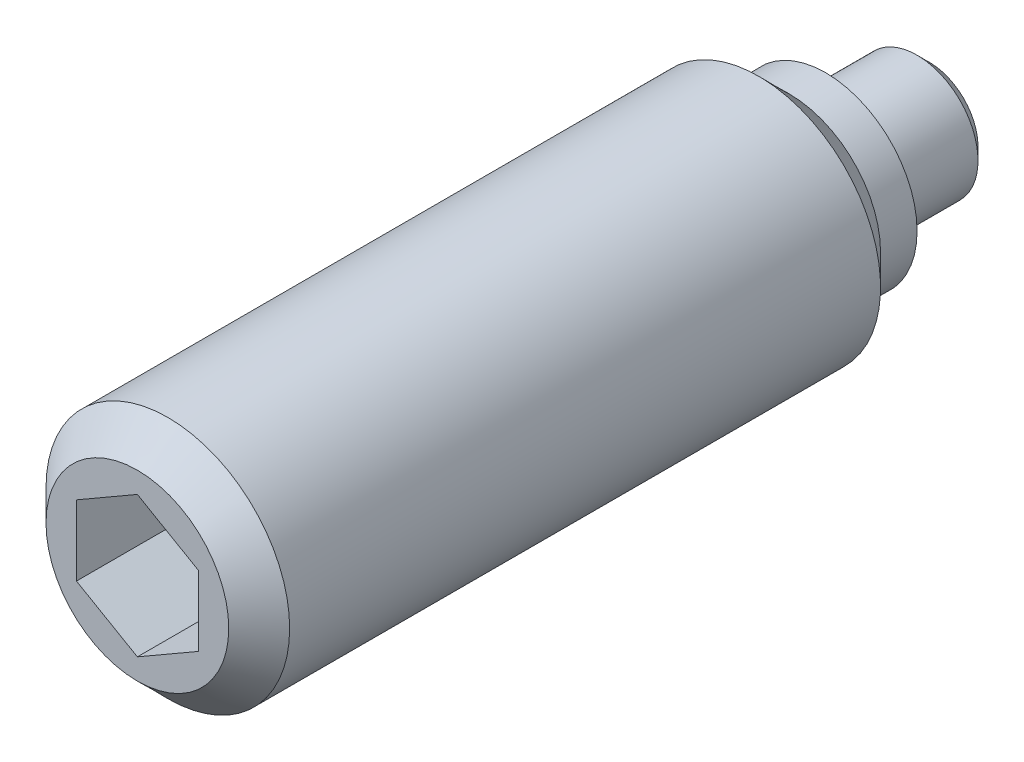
ISO-10303-21;
HEADER;
FILE_DESCRIPTION(('STEP AP214'),'2;1');
FILE_NAME('part.step','',(''),(''),'','','');
FILE_SCHEMA(('AUTOMOTIVE_DESIGN { 1 0 10303 214 1 1 1 1 }'));
ENDSEC;
DATA;
#1=APPLICATION_CONTEXT('core data for automotive mechanical design processes');
#2=APPLICATION_PROTOCOL_DEFINITION('international standard','automotive_design',2000,#1);
#3=PRODUCT_CONTEXT('',#1,'mechanical');
#4=PRODUCT('Part','Part','',(#3));
#5=PRODUCT_RELATED_PRODUCT_CATEGORY('part','',(#4));
#6=PRODUCT_DEFINITION_FORMATION('','',#4);
#7=PRODUCT_DEFINITION_CONTEXT('part definition',#1,'design');
#8=PRODUCT_DEFINITION('design','',#6,#7);
#9=PRODUCT_DEFINITION_SHAPE('','',#8);
#10=(LENGTH_UNIT() NAMED_UNIT(*) SI_UNIT(.MILLI.,.METRE.));
#11=(NAMED_UNIT(*) PLANE_ANGLE_UNIT() SI_UNIT($,.RADIAN.));
#12=(NAMED_UNIT(*) SI_UNIT($,.STERADIAN.) SOLID_ANGLE_UNIT());
#13=UNCERTAINTY_MEASURE_WITH_UNIT(LENGTH_MEASURE(1.E-05),#10,'distance_accuracy_value','');
#14=(GEOMETRIC_REPRESENTATION_CONTEXT(3) GLOBAL_UNCERTAINTY_ASSIGNED_CONTEXT((#13)) GLOBAL_UNIT_ASSIGNED_CONTEXT((#10,
#11,#12)) REPRESENTATION_CONTEXT('',''));
#15=CARTESIAN_POINT('',(0.,0.,0.));
#16=DIRECTION('',(0.,0.,1.));
#17=DIRECTION('',(1.,0.,0.));
#18=AXIS2_PLACEMENT_3D('',#15,#16,#17);
#19=CARTESIAN_POINT('',(0.,0.,0.));
#20=DIRECTION('',(0.,0.,-1.));
#21=DIRECTION('',(-1.,0.,0.));
#22=AXIS2_PLACEMENT_3D('',#19,#20,#21);
#23=CYLINDRICAL_SURFACE('',#22,1.);
#24=CARTESIAN_POINT('',(0.,0.,0.2));
#25=DIRECTION('',(0.,0.,-1.));
#26=DIRECTION('',(-1.,0.,0.));
#27=AXIS2_PLACEMENT_3D('',#24,#25,#26);
#28=CIRCLE('',#27,1.);
#29=CARTESIAN_POINT('',(-1.,0.,0.2));
#30=VERTEX_POINT('',#29);
#31=EDGE_CURVE('E133',#30,#30,#28,.T.);
#32=ORIENTED_EDGE('',*,*,#31,.F.);
#33=EDGE_LOOP('',(#32));
#34=FACE_BOUND('',#33,.T.);
#35=CARTESIAN_POINT('',(0.,0.,1.7));
#36=DIRECTION('',(0.,0.,-1.));
#37=DIRECTION('',(-1.,0.,0.));
#38=AXIS2_PLACEMENT_3D('',#35,#36,#37);
#39=CIRCLE('',#38,1.);
#40=CARTESIAN_POINT('',(-1.,0.,1.7));
#41=VERTEX_POINT('',#40);
#42=EDGE_CURVE('E127',#41,#41,#39,.T.);
#43=ORIENTED_EDGE('',*,*,#42,.T.);
#44=EDGE_LOOP('',(#43));
#45=FACE_BOUND('',#44,.T.);
#46=ADVANCED_FACE('F14',(#34,#45),#23,.T.);
#47=CARTESIAN_POINT('',(0.,0.,0.2));
#48=DIRECTION('',(0.,0.,1.));
#49=DIRECTION('',(1.,0.,0.));
#50=AXIS2_PLACEMENT_3D('',#47,#48,#49);
#51=CONICAL_SURFACE('',#50,1.,0.785398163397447);
#52=CARTESIAN_POINT('',(0.,0.,0.));
#53=DIRECTION('',(0.,0.,-1.));
#54=DIRECTION('',(-1.,0.,0.));
#55=AXIS2_PLACEMENT_3D('',#52,#53,#54);
#56=CIRCLE('',#55,0.8);
#57=CARTESIAN_POINT('',(-0.8,0.,0.));
#58=VERTEX_POINT('',#57);
#59=EDGE_CURVE('E130',#58,#58,#56,.T.);
#60=ORIENTED_EDGE('',*,*,#59,.F.);
#61=EDGE_LOOP('',(#60));
#62=FACE_BOUND('',#61,.T.);
#63=ORIENTED_EDGE('',*,*,#31,.T.);
#64=EDGE_LOOP('',(#63));
#65=FACE_BOUND('',#64,.T.);
#66=ADVANCED_FACE('F157',(#62,#65),#51,.T.);
#67=CARTESIAN_POINT('',(0.,0.8,0.));
#68=DIRECTION('',(0.,0.,1.));
#69=DIRECTION('',(1.,0.,0.));
#70=AXIS2_PLACEMENT_3D('',#67,#68,#69);
#71=PLANE('',#70);
#72=ORIENTED_EDGE('',*,*,#59,.T.);
#73=EDGE_LOOP('',(#72));
#74=FACE_BOUND('',#73,.T.);
#75=ADVANCED_FACE('F154',(#74),#71,.F.);
#76=CARTESIAN_POINT('',(0.,0.,1.7));
#77=DIRECTION('',(0.,0.,-1.));
#78=DIRECTION('',(-1.,0.,0.));
#79=AXIS2_PLACEMENT_3D('',#76,#77,#78);
#80=CYLINDRICAL_SURFACE('',#79,2.);
#81=CARTESIAN_POINT('',(0.,0.,2.8));
#82=DIRECTION('',(0.,0.,-1.));
#83=DIRECTION('',(-1.,0.,0.));
#84=AXIS2_PLACEMENT_3D('',#81,#82,#83);
#85=CIRCLE('',#84,2.);
#86=CARTESIAN_POINT('',(-2.,0.,2.8));
#87=VERTEX_POINT('',#86);
#88=EDGE_CURVE('E9',#87,#87,#85,.T.);
#89=ORIENTED_EDGE('',*,*,#88,.F.);
#90=EDGE_LOOP('',(#89));
#91=FACE_BOUND('',#90,.T.);
#92=CARTESIAN_POINT('',(0.,0.,12.5));
#93=DIRECTION('',(0.,0.,1.));
#94=DIRECTION('',(1.,0.,0.));
#95=AXIS2_PLACEMENT_3D('',#92,#93,#94);
#96=CIRCLE('',#95,2.);
#97=CARTESIAN_POINT('',(2.,0.,12.5));
#98=VERTEX_POINT('',#97);
#99=EDGE_CURVE('E124',#98,#98,#96,.T.);
#100=ORIENTED_EDGE('',*,*,#99,.F.);
#101=EDGE_LOOP('',(#100));
#102=FACE_BOUND('',#101,.T.);
#103=ADVANCED_FACE('F16',(#91,#102),#80,.T.);
#104=CARTESIAN_POINT('',(0.,0.,2.8));
#105=DIRECTION('',(0.,0.,1.));
#106=DIRECTION('',(1.,0.,0.));
#107=AXIS2_PLACEMENT_3D('',#104,#105,#106);
#108=CONICAL_SURFACE('',#107,2.,0.785398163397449);
#109=ORIENTED_EDGE('',*,*,#88,.T.);
#110=EDGE_LOOP('',(#109));
#111=FACE_BOUND('',#110,.T.);
#112=CARTESIAN_POINT('',(0.,0.,2.3));
#113=DIRECTION('',(0.,0.,-1.));
#114=DIRECTION('',(-1.,0.,0.));
#115=AXIS2_PLACEMENT_3D('',#112,#113,#114);
#116=CIRCLE('',#115,1.5);
#117=CARTESIAN_POINT('',(-1.5,0.,2.3));
#118=VERTEX_POINT('',#117);
#119=EDGE_CURVE('E22',#118,#118,#116,.T.);
#120=ORIENTED_EDGE('',*,*,#119,.F.);
#121=EDGE_LOOP('',(#120));
#122=FACE_BOUND('',#121,.T.);
#123=ADVANCED_FACE('F143',(#111,#122),#108,.T.);
#124=CARTESIAN_POINT('',(0.,0.,1.7));
#125=DIRECTION('',(0.,0.,-1.));
#126=DIRECTION('',(-1.,0.,0.));
#127=AXIS2_PLACEMENT_3D('',#124,#125,#126);
#128=CYLINDRICAL_SURFACE('',#127,1.5);
#129=CARTESIAN_POINT('',(0.,0.,1.7));
#130=DIRECTION('',(0.,0.,-1.));
#131=DIRECTION('',(-1.,0.,0.));
#132=AXIS2_PLACEMENT_3D('',#129,#130,#131);
#133=CIRCLE('',#132,1.5);
#134=CARTESIAN_POINT('',(-1.5,0.,1.7));
#135=VERTEX_POINT('',#134);
#136=EDGE_CURVE('E136',#135,#135,#133,.T.);
#137=ORIENTED_EDGE('',*,*,#136,.F.);
#138=EDGE_LOOP('',(#137));
#139=FACE_BOUND('',#138,.T.);
#140=ORIENTED_EDGE('',*,*,#119,.T.);
#141=EDGE_LOOP('',(#140));
#142=FACE_BOUND('',#141,.T.);
#143=ADVANCED_FACE('F141',(#139,#142),#128,.T.);
#144=CARTESIAN_POINT('',(0.,1.5,1.7));
#145=DIRECTION('',(0.,0.,1.));
#146=DIRECTION('',(1.,0.,0.));
#147=AXIS2_PLACEMENT_3D('',#144,#145,#146);
#148=PLANE('',#147);
#149=ORIENTED_EDGE('',*,*,#136,.T.);
#150=EDGE_LOOP('',(#149));
#151=FACE_BOUND('',#150,.T.);
#152=ORIENTED_EDGE('',*,*,#42,.F.);
#153=EDGE_LOOP('',(#152));
#154=FACE_BOUND('',#153,.T.);
#155=ADVANCED_FACE('F151',(#151,#154),#148,.F.);
#156=CARTESIAN_POINT('',(0.,-1.5,13.));
#157=DIRECTION('',(0.,0.,1.));
#158=DIRECTION('',(1.,0.,0.));
#159=AXIS2_PLACEMENT_3D('',#156,#157,#158);
#160=PLANE('',#159);
#161=DIRECTION('',(0.866025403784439,-0.5,0.));
#162=VECTOR('',#161,1.);
#163=CARTESIAN_POINT('',(-1.,-0.577350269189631,13.));
#164=LINE('',#163,#162);
#165=CARTESIAN_POINT('',(-1.,-0.577350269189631,13.));
#166=VERTEX_POINT('',#165);
#167=CARTESIAN_POINT('',(0.,-1.15470053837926,13.));
#168=VERTEX_POINT('',#167);
#169=EDGE_CURVE('E29',#166,#168,#164,.T.);
#170=ORIENTED_EDGE('',*,*,#169,.F.);
#171=DIRECTION('',(0.,-1.,0.));
#172=VECTOR('',#171,1.);
#173=CARTESIAN_POINT('',(-1.,0.577350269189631,13.));
#174=LINE('',#173,#172);
#175=CARTESIAN_POINT('',(-1.,0.577350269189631,13.));
#176=VERTEX_POINT('',#175);
#177=EDGE_CURVE('E112',#176,#166,#174,.T.);
#178=ORIENTED_EDGE('',*,*,#177,.F.);
#179=DIRECTION('',(-0.866025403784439,-0.5,0.));
#180=VECTOR('',#179,1.);
#181=CARTESIAN_POINT('',(0.,1.15470053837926,13.));
#182=LINE('',#181,#180);
#183=CARTESIAN_POINT('',(0.,1.15470053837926,13.));
#184=VERTEX_POINT('',#183);
#185=EDGE_CURVE('E110',#184,#176,#182,.T.);
#186=ORIENTED_EDGE('',*,*,#185,.F.);
#187=DIRECTION('',(-0.866025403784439,0.5,0.));
#188=VECTOR('',#187,1.);
#189=CARTESIAN_POINT('',(1.,0.577350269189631,13.));
#190=LINE('',#189,#188);
#191=CARTESIAN_POINT('',(1.,0.577350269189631,13.));
#192=VERTEX_POINT('',#191);
#193=EDGE_CURVE('E77',#192,#184,#190,.T.);
#194=ORIENTED_EDGE('',*,*,#193,.F.);
#195=DIRECTION('',(0.,1.,0.));
#196=VECTOR('',#195,1.);
#197=CARTESIAN_POINT('',(1.,-0.577350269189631,13.));
#198=LINE('',#197,#196);
#199=CARTESIAN_POINT('',(1.,-0.577350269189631,13.));
#200=VERTEX_POINT('',#199);
#201=EDGE_CURVE('E106',#200,#192,#198,.T.);
#202=ORIENTED_EDGE('',*,*,#201,.F.);
#203=DIRECTION('',(0.866025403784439,0.5,0.));
#204=VECTOR('',#203,1.);
#205=CARTESIAN_POINT('',(0.,-1.15470053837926,13.));
#206=LINE('',#205,#204);
#207=EDGE_CURVE('E103',#168,#200,#206,.T.);
#208=ORIENTED_EDGE('',*,*,#207,.F.);
#209=EDGE_LOOP('',(#170,#178,#186,#194,#202,#208));
#210=FACE_BOUND('',#209,.T.);
#211=CARTESIAN_POINT('',(0.,0.,13.));
#212=DIRECTION('',(0.,0.,1.));
#213=DIRECTION('',(1.,0.,0.));
#214=AXIS2_PLACEMENT_3D('',#211,#212,#213);
#215=CIRCLE('',#214,1.5);
#216=CARTESIAN_POINT('',(1.5,0.,13.));
#217=VERTEX_POINT('',#216);
#218=EDGE_CURVE('E116',#217,#217,#215,.T.);
#219=ORIENTED_EDGE('',*,*,#218,.T.);
#220=EDGE_LOOP('',(#219));
#221=FACE_BOUND('',#220,.T.);
#222=ADVANCED_FACE('F170',(#210,#221),#160,.T.);
#223=CARTESIAN_POINT('',(0.,0.,13.));
#224=DIRECTION('',(0.,0.,-1.));
#225=DIRECTION('',(-1.,0.,0.));
#226=AXIS2_PLACEMENT_3D('',#223,#224,#225);
#227=CONICAL_SURFACE('',#226,1.5,0.78539816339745);
#228=ORIENTED_EDGE('',*,*,#99,.T.);
#229=EDGE_LOOP('',(#228));
#230=FACE_BOUND('',#229,.T.);
#231=ORIENTED_EDGE('',*,*,#218,.F.);
#232=EDGE_LOOP('',(#231));
#233=FACE_BOUND('',#232,.T.);
#234=ADVANCED_FACE('F175',(#230,#233),#227,.T.);
#235=CARTESIAN_POINT('',(-1.,-0.577350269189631,10.5));
#236=DIRECTION('',(-0.5,-0.866025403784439,0.));
#237=DIRECTION('',(0.866025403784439,-0.5,0.));
#238=AXIS2_PLACEMENT_3D('',#235,#236,#237);
#239=PLANE('',#238);
#240=ORIENTED_EDGE('',*,*,#169,.T.);
#241=DIRECTION('',(0.,0.,1.));
#242=VECTOR('',#241,1.);
#243=CARTESIAN_POINT('',(0.,-1.15470053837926,10.5));
#244=LINE('',#243,#242);
#245=CARTESIAN_POINT('',(0.,-1.15470053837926,10.5));
#246=VERTEX_POINT('',#245);
#247=EDGE_CURVE('E59',#246,#168,#244,.T.);
#248=ORIENTED_EDGE('',*,*,#247,.F.);
#249=DIRECTION('',(0.866025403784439,-0.5,0.));
#250=VECTOR('',#249,1.);
#251=CARTESIAN_POINT('',(-1.,-0.577350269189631,10.5));
#252=LINE('',#251,#250);
#253=CARTESIAN_POINT('',(-1.,-0.577350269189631,10.5));
#254=VERTEX_POINT('',#253);
#255=EDGE_CURVE('E114',#254,#246,#252,.T.);
#256=ORIENTED_EDGE('',*,*,#255,.F.);
#257=DIRECTION('',(0.,0.,1.));
#258=VECTOR('',#257,1.);
#259=CARTESIAN_POINT('',(-1.,-0.577350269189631,10.5));
#260=LINE('',#259,#258);
#261=EDGE_CURVE('E37',#254,#166,#260,.T.);
#262=ORIENTED_EDGE('',*,*,#261,.T.);
#263=EDGE_LOOP('',(#240,#248,#256,#262));
#264=FACE_BOUND('',#263,.T.);
#265=ADVANCED_FACE('F184',(#264),#239,.F.);
#266=CARTESIAN_POINT('',(-1.,0.577350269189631,10.5));
#267=DIRECTION('',(-1.,0.,0.));
#268=DIRECTION('',(0.,0.,1.));
#269=AXIS2_PLACEMENT_3D('',#266,#267,#268);
#270=PLANE('',#269);
#271=ORIENTED_EDGE('',*,*,#177,.T.);
#272=ORIENTED_EDGE('',*,*,#261,.F.);
#273=DIRECTION('',(0.,-1.,0.));
#274=VECTOR('',#273,1.);
#275=CARTESIAN_POINT('',(-1.,0.577350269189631,10.5));
#276=LINE('',#275,#274);
#277=CARTESIAN_POINT('',(-1.,0.577350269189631,10.5));
#278=VERTEX_POINT('',#277);
#279=EDGE_CURVE('E89',#278,#254,#276,.T.);
#280=ORIENTED_EDGE('',*,*,#279,.F.);
#281=DIRECTION('',(0.,0.,1.));
#282=VECTOR('',#281,1.);
#283=CARTESIAN_POINT('',(-1.,0.577350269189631,10.5));
#284=LINE('',#283,#282);
#285=EDGE_CURVE('E81',#278,#176,#284,.T.);
#286=ORIENTED_EDGE('',*,*,#285,.T.);
#287=EDGE_LOOP('',(#271,#272,#280,#286));
#288=FACE_BOUND('',#287,.T.);
#289=ADVANCED_FACE('F244',(#288),#270,.F.);
#290=CARTESIAN_POINT('',(0.,1.15470053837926,10.5));
#291=DIRECTION('',(-0.5,0.866025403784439,0.));
#292=DIRECTION('',(-0.866025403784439,-0.5,0.));
#293=AXIS2_PLACEMENT_3D('',#290,#291,#292);
#294=PLANE('',#293);
#295=ORIENTED_EDGE('',*,*,#185,.T.);
#296=ORIENTED_EDGE('',*,*,#285,.F.);
#297=DIRECTION('',(-0.866025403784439,-0.5,0.));
#298=VECTOR('',#297,1.);
#299=CARTESIAN_POINT('',(0.,1.15470053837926,10.5));
#300=LINE('',#299,#298);
#301=CARTESIAN_POINT('',(0.,1.15470053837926,10.5));
#302=VERTEX_POINT('',#301);
#303=EDGE_CURVE('E85',#302,#278,#300,.T.);
#304=ORIENTED_EDGE('',*,*,#303,.F.);
#305=DIRECTION('',(0.,0.,1.));
#306=VECTOR('',#305,1.);
#307=CARTESIAN_POINT('',(0.,1.15470053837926,10.5));
#308=LINE('',#307,#306);
#309=EDGE_CURVE('E70',#302,#184,#308,.T.);
#310=ORIENTED_EDGE('',*,*,#309,.T.);
#311=EDGE_LOOP('',(#295,#296,#304,#310));
#312=FACE_BOUND('',#311,.T.);
#313=ADVANCED_FACE('F86',(#312),#294,.F.);
#314=CARTESIAN_POINT('',(1.,0.577350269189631,10.5));
#315=DIRECTION('',(0.5,0.866025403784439,0.));
#316=DIRECTION('',(-0.866025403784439,0.5,0.));
#317=AXIS2_PLACEMENT_3D('',#314,#315,#316);
#318=PLANE('',#317);
#319=ORIENTED_EDGE('',*,*,#193,.T.);
#320=ORIENTED_EDGE('',*,*,#309,.F.);
#321=DIRECTION('',(-0.866025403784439,0.5,0.));
#322=VECTOR('',#321,1.);
#323=CARTESIAN_POINT('',(1.,0.577350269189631,10.5));
#324=LINE('',#323,#322);
#325=CARTESIAN_POINT('',(1.,0.577350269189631,10.5));
#326=VERTEX_POINT('',#325);
#327=EDGE_CURVE('E74',#326,#302,#324,.T.);
#328=ORIENTED_EDGE('',*,*,#327,.F.);
#329=DIRECTION('',(0.,0.,1.));
#330=VECTOR('',#329,1.);
#331=CARTESIAN_POINT('',(1.,0.577350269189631,10.5));
#332=LINE('',#331,#330);
#333=EDGE_CURVE('E82',#326,#192,#332,.T.);
#334=ORIENTED_EDGE('',*,*,#333,.T.);
#335=EDGE_LOOP('',(#319,#320,#328,#334));
#336=FACE_BOUND('',#335,.T.);
#337=ADVANCED_FACE('F72',(#336),#318,.F.);
#338=CARTESIAN_POINT('',(1.,-0.577350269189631,10.5));
#339=DIRECTION('',(1.,0.,0.));
#340=DIRECTION('',(0.,0.,-1.));
#341=AXIS2_PLACEMENT_3D('',#338,#339,#340);
#342=PLANE('',#341);
#343=ORIENTED_EDGE('',*,*,#201,.T.);
#344=ORIENTED_EDGE('',*,*,#333,.F.);
#345=DIRECTION('',(0.,1.,0.));
#346=VECTOR('',#345,1.);
#347=CARTESIAN_POINT('',(1.,-0.577350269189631,10.5));
#348=LINE('',#347,#346);
#349=CARTESIAN_POINT('',(1.,-0.577350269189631,10.5));
#350=VERTEX_POINT('',#349);
#351=EDGE_CURVE('E95',#350,#326,#348,.T.);
#352=ORIENTED_EDGE('',*,*,#351,.F.);
#353=DIRECTION('',(0.,0.,1.));
#354=VECTOR('',#353,1.);
#355=CARTESIAN_POINT('',(1.,-0.577350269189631,10.5));
#356=LINE('',#355,#354);
#357=EDGE_CURVE('E119',#350,#200,#356,.T.);
#358=ORIENTED_EDGE('',*,*,#357,.T.);
#359=EDGE_LOOP('',(#343,#344,#352,#358));
#360=FACE_BOUND('',#359,.T.);
#361=ADVANCED_FACE('F268',(#360),#342,.F.);
#362=CARTESIAN_POINT('',(0.,-1.15470053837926,10.5));
#363=DIRECTION('',(0.5,-0.866025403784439,0.));
#364=DIRECTION('',(0.866025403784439,0.5,0.));
#365=AXIS2_PLACEMENT_3D('',#362,#363,#364);
#366=PLANE('',#365);
#367=ORIENTED_EDGE('',*,*,#207,.T.);
#368=ORIENTED_EDGE('',*,*,#357,.F.);
#369=DIRECTION('',(0.866025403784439,0.5,0.));
#370=VECTOR('',#369,1.);
#371=CARTESIAN_POINT('',(0.,-1.15470053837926,10.5));
#372=LINE('',#371,#370);
#373=EDGE_CURVE('E97',#246,#350,#372,.T.);
#374=ORIENTED_EDGE('',*,*,#373,.F.);
#375=ORIENTED_EDGE('',*,*,#247,.T.);
#376=EDGE_LOOP('',(#367,#368,#374,#375));
#377=FACE_BOUND('',#376,.T.);
#378=ADVANCED_FACE('F277',(#377),#366,.F.);
#379=CARTESIAN_POINT('',(0.,0.,10.5));
#380=DIRECTION('',(0.,0.,1.));
#381=DIRECTION('',(1.,0.,0.));
#382=AXIS2_PLACEMENT_3D('',#379,#380,#381);
#383=PLANE('',#382);
#384=ORIENTED_EDGE('',*,*,#255,.T.);
#385=ORIENTED_EDGE('',*,*,#373,.T.);
#386=ORIENTED_EDGE('',*,*,#351,.T.);
#387=ORIENTED_EDGE('',*,*,#327,.T.);
#388=ORIENTED_EDGE('',*,*,#303,.T.);
#389=ORIENTED_EDGE('',*,*,#279,.T.);
#390=EDGE_LOOP('',(#384,#385,#386,#387,#388,#389));
#391=FACE_BOUND('',#390,.T.);
#392=ADVANCED_FACE('F92',(#391),#383,.T.);
#393=CLOSED_SHELL('',(#46,#66,#75,#103,#123,#143,#155,#222,#234,#265,#289,#313,#337,#361,#378,#392));
#394=MANIFOLD_SOLID_BREP('B1',#393);
#395=ADVANCED_BREP_SHAPE_REPRESENTATION('',(#18,#394),#14);
#396=SHAPE_DEFINITION_REPRESENTATION(#9,#395);
ENDSEC;
END-ISO-10303-21;
